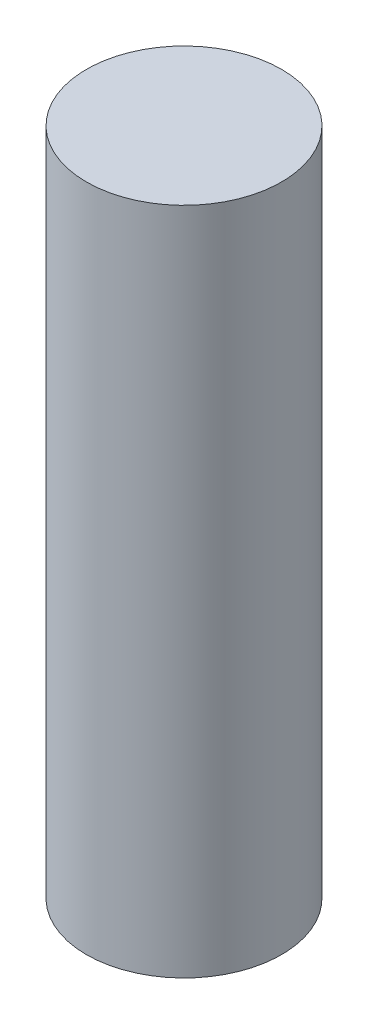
from build123d import *

# Parameters (mm, degrees)
SKETCH1_R           = 44.45
BOSS_EXTRUDE1_DEPTH = 304.8


with BuildPart() as part:
    # Sketch1 → Boss-Extrude1 (new body)
    with BuildSketch(Plane(origin=(0, 0, 0), x_dir=(1, 0, 0), z_dir=(0, 1, 0))):
        with Locations(Location((0, 0, 0), (0, 0, 90))):
            Circle(SKETCH1_R)
    extrude(amount=BOSS_EXTRUDE1_DEPTH)


solid = part.part
